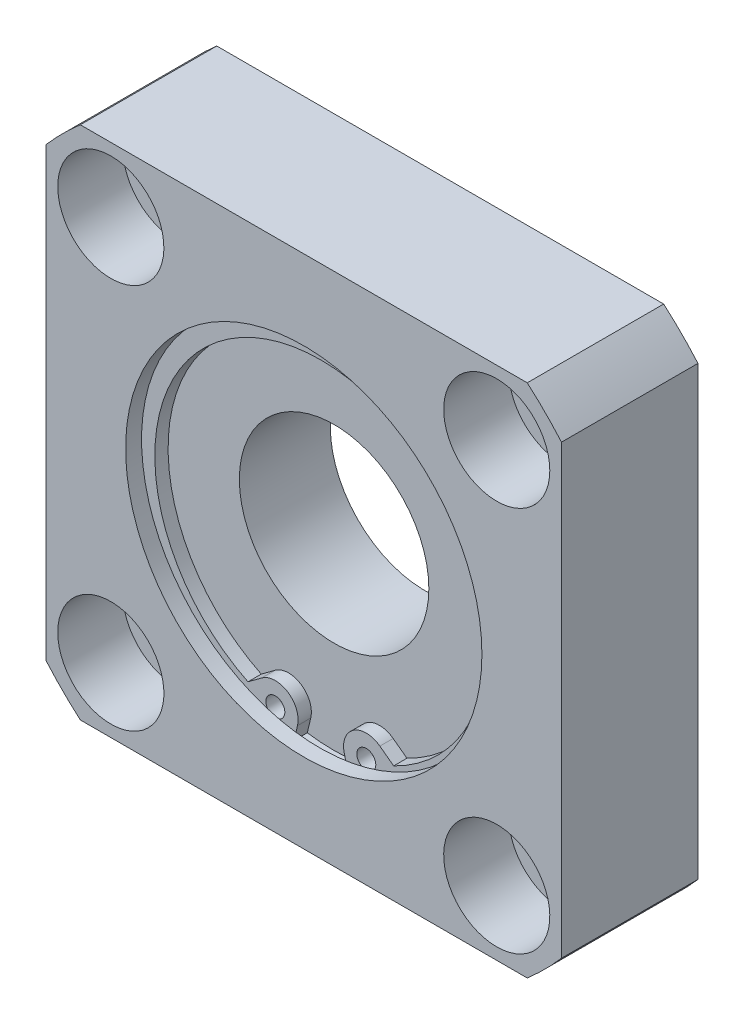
ISO-10303-21;
HEADER;
FILE_DESCRIPTION(('STEP AP214'),'2;1');
FILE_NAME('part.step','',(''),(''),'','','');
FILE_SCHEMA(('AUTOMOTIVE_DESIGN { 1 0 10303 214 1 1 1 1 }'));
ENDSEC;
DATA;
#1=APPLICATION_CONTEXT('core data for automotive mechanical design processes');
#2=APPLICATION_PROTOCOL_DEFINITION('international standard','automotive_design',2000,#1);
#3=PRODUCT_CONTEXT('',#1,'mechanical');
#4=PRODUCT('Part','Part','',(#3));
#5=PRODUCT_RELATED_PRODUCT_CATEGORY('part','',(#4));
#6=PRODUCT_DEFINITION_FORMATION('','',#4);
#7=PRODUCT_DEFINITION_CONTEXT('part definition',#1,'design');
#8=PRODUCT_DEFINITION('design','',#6,#7);
#9=PRODUCT_DEFINITION_SHAPE('','',#8);
#10=(LENGTH_UNIT() NAMED_UNIT(*) SI_UNIT(.MILLI.,.METRE.));
#11=(NAMED_UNIT(*) PLANE_ANGLE_UNIT() SI_UNIT($,.RADIAN.));
#12=(NAMED_UNIT(*) SI_UNIT($,.STERADIAN.) SOLID_ANGLE_UNIT());
#13=UNCERTAINTY_MEASURE_WITH_UNIT(LENGTH_MEASURE(1.E-05),#10,'distance_accuracy_value','');
#14=(GEOMETRIC_REPRESENTATION_CONTEXT(3) GLOBAL_UNCERTAINTY_ASSIGNED_CONTEXT((#13)) GLOBAL_UNIT_ASSIGNED_CONTEXT((#10,
#11,#12)) REPRESENTATION_CONTEXT('',''));
#15=CARTESIAN_POINT('',(0.,0.,0.));
#16=DIRECTION('',(0.,0.,1.));
#17=DIRECTION('',(1.,0.,0.));
#18=AXIS2_PLACEMENT_3D('',#15,#16,#17);
#19=CARTESIAN_POINT('',(25.4558441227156,25.4558441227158,0.));
#20=DIRECTION('',(0.,0.,1.));
#21=DIRECTION('',(1.,0.,0.));
#22=AXIS2_PLACEMENT_3D('',#19,#20,#21);
#23=CYLINDRICAL_SURFACE('',#22,5.);
#24=CARTESIAN_POINT('',(25.4558441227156,25.4558441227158,0.));
#25=DIRECTION('',(0.,0.,1.));
#26=DIRECTION('',(1.,0.,0.));
#27=AXIS2_PLACEMENT_3D('',#24,#25,#26);
#28=CIRCLE('',#27,5.);
#29=CARTESIAN_POINT('',(30.4558441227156,25.4558441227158,0.));
#30=VERTEX_POINT('',#29);
#31=EDGE_CURVE('E268',#30,#30,#28,.T.);
#32=ORIENTED_EDGE('',*,*,#31,.F.);
#33=EDGE_LOOP('',(#32));
#34=FACE_BOUND('',#33,.T.);
#35=CARTESIAN_POINT('',(25.4558441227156,25.4558441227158,9.4));
#36=DIRECTION('',(0.,0.,1.));
#37=DIRECTION('',(1.,0.,0.));
#38=AXIS2_PLACEMENT_3D('',#35,#36,#37);
#39=CIRCLE('',#38,5.);
#40=CARTESIAN_POINT('',(30.4558441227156,25.4558441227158,9.4));
#41=VERTEX_POINT('',#40);
#42=EDGE_CURVE('E267',#41,#41,#39,.F.);
#43=ORIENTED_EDGE('',*,*,#42,.F.);
#44=EDGE_LOOP('',(#43));
#45=FACE_BOUND('',#44,.T.);
#46=ADVANCED_FACE('F14',(#34,#45),#23,.F.);
#47=CARTESIAN_POINT('',(25.4558441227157,-25.4558441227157,0.));
#48=DIRECTION('',(0.,0.,1.));
#49=DIRECTION('',(1.,0.,0.));
#50=AXIS2_PLACEMENT_3D('',#47,#48,#49);
#51=CYLINDRICAL_SURFACE('',#50,5.);
#52=CARTESIAN_POINT('',(25.4558441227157,-25.4558441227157,0.));
#53=DIRECTION('',(0.,0.,1.));
#54=DIRECTION('',(0.,-1.,0.));
#55=AXIS2_PLACEMENT_3D('',#52,#53,#54);
#56=CIRCLE('',#55,5.);
#57=CARTESIAN_POINT('',(25.4558441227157,-30.4558441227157,0.));
#58=VERTEX_POINT('',#57);
#59=EDGE_CURVE('E258',#58,#58,#56,.T.);
#60=ORIENTED_EDGE('',*,*,#59,.F.);
#61=EDGE_LOOP('',(#60));
#62=FACE_BOUND('',#61,.T.);
#63=CARTESIAN_POINT('',(25.4558441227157,-25.4558441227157,9.4));
#64=DIRECTION('',(0.,0.,1.));
#65=DIRECTION('',(1.,0.,0.));
#66=AXIS2_PLACEMENT_3D('',#63,#64,#65);
#67=CIRCLE('',#66,5.);
#68=CARTESIAN_POINT('',(30.4558441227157,-25.4558441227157,9.4));
#69=VERTEX_POINT('',#68);
#70=EDGE_CURVE('E251',#69,#69,#67,.F.);
#71=ORIENTED_EDGE('',*,*,#70,.F.);
#72=EDGE_LOOP('',(#71));
#73=FACE_BOUND('',#72,.T.);
#74=ADVANCED_FACE('F466',(#62,#73),#51,.F.);
#75=CARTESIAN_POINT('',(-25.4558441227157,-25.4558441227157,0.));
#76=DIRECTION('',(0.,0.,1.));
#77=DIRECTION('',(1.,0.,0.));
#78=AXIS2_PLACEMENT_3D('',#75,#76,#77);
#79=CYLINDRICAL_SURFACE('',#78,5.);
#80=CARTESIAN_POINT('',(-25.4558441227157,-25.4558441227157,0.));
#81=DIRECTION('',(0.,0.,1.));
#82=DIRECTION('',(-1.,0.,0.));
#83=AXIS2_PLACEMENT_3D('',#80,#81,#82);
#84=CIRCLE('',#83,5.);
#85=CARTESIAN_POINT('',(-30.4558441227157,-25.4558441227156,0.));
#86=VERTEX_POINT('',#85);
#87=EDGE_CURVE('E255',#86,#86,#84,.T.);
#88=ORIENTED_EDGE('',*,*,#87,.F.);
#89=EDGE_LOOP('',(#88));
#90=FACE_BOUND('',#89,.T.);
#91=CARTESIAN_POINT('',(-25.4558441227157,-25.4558441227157,9.4));
#92=DIRECTION('',(0.,0.,1.));
#93=DIRECTION('',(1.,0.,0.));
#94=AXIS2_PLACEMENT_3D('',#91,#92,#93);
#95=CIRCLE('',#94,5.);
#96=CARTESIAN_POINT('',(-20.4558441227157,-25.4558441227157,9.4));
#97=VERTEX_POINT('',#96);
#98=EDGE_CURVE('E244',#97,#97,#95,.F.);
#99=ORIENTED_EDGE('',*,*,#98,.F.);
#100=EDGE_LOOP('',(#99));
#101=FACE_BOUND('',#100,.T.);
#102=ADVANCED_FACE('F480',(#90,#101),#79,.F.);
#103=CARTESIAN_POINT('',(-25.4558441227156,25.4558441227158,0.));
#104=DIRECTION('',(0.,0.,1.));
#105=DIRECTION('',(1.,0.,0.));
#106=AXIS2_PLACEMENT_3D('',#103,#104,#105);
#107=CYLINDRICAL_SURFACE('',#106,5.);
#108=CARTESIAN_POINT('',(-25.4558441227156,25.4558441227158,0.));
#109=DIRECTION('',(0.,0.,1.));
#110=DIRECTION('',(0.,1.,0.));
#111=AXIS2_PLACEMENT_3D('',#108,#109,#110);
#112=CIRCLE('',#111,5.);
#113=CARTESIAN_POINT('',(-25.4558441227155,30.4558441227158,0.));
#114=VERTEX_POINT('',#113);
#115=EDGE_CURVE('E252',#114,#114,#112,.T.);
#116=ORIENTED_EDGE('',*,*,#115,.F.);
#117=EDGE_LOOP('',(#116));
#118=FACE_BOUND('',#117,.T.);
#119=CARTESIAN_POINT('',(-25.4558441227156,25.4558441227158,9.4));
#120=DIRECTION('',(0.,0.,1.));
#121=DIRECTION('',(1.,0.,0.));
#122=AXIS2_PLACEMENT_3D('',#119,#120,#121);
#123=CIRCLE('',#122,5.);
#124=CARTESIAN_POINT('',(-20.4558441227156,25.4558441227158,9.4));
#125=VERTEX_POINT('',#124);
#126=EDGE_CURVE('E237',#125,#125,#123,.F.);
#127=ORIENTED_EDGE('',*,*,#126,.F.);
#128=EDGE_LOOP('',(#127));
#129=FACE_BOUND('',#128,.T.);
#130=ADVANCED_FACE('F476',(#118,#129),#107,.F.);
#131=CARTESIAN_POINT('',(25.4558441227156,25.4558441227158,9.4));
#132=DIRECTION('',(0.,0.,1.));
#133=DIRECTION('',(1.,0.,0.));
#134=AXIS2_PLACEMENT_3D('',#131,#132,#133);
#135=PLANE('',#134);
#136=CARTESIAN_POINT('',(25.4558441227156,25.4558441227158,9.4));
#137=DIRECTION('',(0.,0.,1.));
#138=DIRECTION('',(1.,0.,0.));
#139=AXIS2_PLACEMENT_3D('',#136,#137,#138);
#140=CIRCLE('',#139,7.);
#141=CARTESIAN_POINT('',(32.4558441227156,25.4558441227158,9.4));
#142=VERTEX_POINT('',#141);
#143=EDGE_CURVE('E264',#142,#142,#140,.T.);
#144=ORIENTED_EDGE('',*,*,#143,.T.);
#145=EDGE_LOOP('',(#144));
#146=FACE_BOUND('',#145,.T.);
#147=ORIENTED_EDGE('',*,*,#42,.T.);
#148=EDGE_LOOP('',(#147));
#149=FACE_BOUND('',#148,.T.);
#150=ADVANCED_FACE('F472',(#146,#149),#135,.T.);
#151=CARTESIAN_POINT('',(25.4558441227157,-25.4558441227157,9.4));
#152=DIRECTION('',(0.,0.,1.));
#153=DIRECTION('',(0.,-1.,0.));
#154=AXIS2_PLACEMENT_3D('',#151,#152,#153);
#155=PLANE('',#154);
#156=CARTESIAN_POINT('',(25.4558441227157,-25.4558441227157,9.4));
#157=DIRECTION('',(0.,0.,1.));
#158=DIRECTION('',(0.,-1.,0.));
#159=AXIS2_PLACEMENT_3D('',#156,#157,#158);
#160=CIRCLE('',#159,7.);
#161=CARTESIAN_POINT('',(25.4558441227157,-32.4558441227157,9.4));
#162=VERTEX_POINT('',#161);
#163=EDGE_CURVE('E248',#162,#162,#160,.T.);
#164=ORIENTED_EDGE('',*,*,#163,.T.);
#165=EDGE_LOOP('',(#164));
#166=FACE_BOUND('',#165,.T.);
#167=ORIENTED_EDGE('',*,*,#70,.T.);
#168=EDGE_LOOP('',(#167));
#169=FACE_BOUND('',#168,.T.);
#170=ADVANCED_FACE('F475',(#166,#169),#155,.T.);
#171=CARTESIAN_POINT('',(-25.4558441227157,-25.4558441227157,9.4));
#172=DIRECTION('',(0.,0.,1.));
#173=DIRECTION('',(-1.,0.,0.));
#174=AXIS2_PLACEMENT_3D('',#171,#172,#173);
#175=PLANE('',#174);
#176=CARTESIAN_POINT('',(-25.4558441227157,-25.4558441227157,9.4));
#177=DIRECTION('',(0.,0.,1.));
#178=DIRECTION('',(-1.,0.,0.));
#179=AXIS2_PLACEMENT_3D('',#176,#177,#178);
#180=CIRCLE('',#179,7.);
#181=CARTESIAN_POINT('',(-32.4558441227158,-25.4558441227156,9.4));
#182=VERTEX_POINT('',#181);
#183=EDGE_CURVE('E241',#182,#182,#180,.T.);
#184=ORIENTED_EDGE('',*,*,#183,.T.);
#185=EDGE_LOOP('',(#184));
#186=FACE_BOUND('',#185,.T.);
#187=ORIENTED_EDGE('',*,*,#98,.T.);
#188=EDGE_LOOP('',(#187));
#189=FACE_BOUND('',#188,.T.);
#190=ADVANCED_FACE('F494',(#186,#189),#175,.T.);
#191=CARTESIAN_POINT('',(-25.4558441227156,25.4558441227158,9.4));
#192=DIRECTION('',(0.,0.,1.));
#193=DIRECTION('',(0.,1.,0.));
#194=AXIS2_PLACEMENT_3D('',#191,#192,#193);
#195=PLANE('',#194);
#196=CARTESIAN_POINT('',(-25.4558441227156,25.4558441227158,9.4));
#197=DIRECTION('',(0.,0.,1.));
#198=DIRECTION('',(0.,1.,0.));
#199=AXIS2_PLACEMENT_3D('',#196,#197,#198);
#200=CIRCLE('',#199,7.);
#201=CARTESIAN_POINT('',(-25.4558441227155,32.4558441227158,9.4));
#202=VERTEX_POINT('',#201);
#203=EDGE_CURVE('E234',#202,#202,#200,.T.);
#204=ORIENTED_EDGE('',*,*,#203,.T.);
#205=EDGE_LOOP('',(#204));
#206=FACE_BOUND('',#205,.T.);
#207=ORIENTED_EDGE('',*,*,#126,.T.);
#208=EDGE_LOOP('',(#207));
#209=FACE_BOUND('',#208,.T.);
#210=ADVANCED_FACE('F457',(#206,#209),#195,.T.);
#211=CARTESIAN_POINT('',(0.,0.,0.));
#212=DIRECTION('',(0.,0.,-1.));
#213=DIRECTION('',(-1.,0.,0.));
#214=AXIS2_PLACEMENT_3D('',#211,#212,#213);
#215=PLANE('',#214);
#216=CARTESIAN_POINT('',(0.,0.,0.));
#217=DIRECTION('',(0.,0.,-1.));
#218=DIRECTION('',(-1.,0.,0.));
#219=AXIS2_PLACEMENT_3D('',#216,#217,#218);
#220=CIRCLE('',#219,20.5);
#221=CARTESIAN_POINT('',(-20.5,0.,0.));
#222=VERTEX_POINT('',#221);
#223=EDGE_CURVE('E220',#222,#222,#220,.T.);
#224=ORIENTED_EDGE('',*,*,#223,.F.);
#225=EDGE_LOOP('',(#224));
#226=FACE_BOUND('',#225,.T.);
#227=ORIENTED_EDGE('',*,*,#115,.T.);
#228=EDGE_LOOP('',(#227));
#229=FACE_BOUND('',#228,.T.);
#230=ORIENTED_EDGE('',*,*,#87,.T.);
#231=EDGE_LOOP('',(#230));
#232=FACE_BOUND('',#231,.T.);
#233=ORIENTED_EDGE('',*,*,#59,.T.);
#234=EDGE_LOOP('',(#233));
#235=FACE_BOUND('',#234,.T.);
#236=ORIENTED_EDGE('',*,*,#31,.T.);
#237=EDGE_LOOP('',(#236));
#238=FACE_BOUND('',#237,.T.);
#239=CARTESIAN_POINT('',(0.,0.,0.));
#240=DIRECTION('',(0.,0.,-1.));
#241=DIRECTION('',(-1.,0.,0.));
#242=AXIS2_PLACEMENT_3D('',#239,#240,#241);
#243=CIRCLE('',#242,45.);
#244=CARTESIAN_POINT('',(34.,-29.4788059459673,0.));
#245=VERTEX_POINT('',#244);
#246=CARTESIAN_POINT('',(29.4788059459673,-34.,0.));
#247=VERTEX_POINT('',#246);
#248=EDGE_CURVE('E271',#245,#247,#243,.T.);
#249=ORIENTED_EDGE('',*,*,#248,.T.);
#250=DIRECTION('',(1.,0.,0.));
#251=VECTOR('',#250,1.);
#252=CARTESIAN_POINT('',(-29.4788059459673,-34.,0.));
#253=LINE('',#252,#251);
#254=CARTESIAN_POINT('',(-29.4788059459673,-34.,0.));
#255=VERTEX_POINT('',#254);
#256=EDGE_CURVE('E273',#255,#247,#253,.T.);
#257=ORIENTED_EDGE('',*,*,#256,.F.);
#258=CARTESIAN_POINT('',(0.,0.,0.));
#259=DIRECTION('',(0.,0.,1.));
#260=DIRECTION('',(1.,0.,0.));
#261=AXIS2_PLACEMENT_3D('',#258,#259,#260);
#262=CIRCLE('',#261,45.);
#263=CARTESIAN_POINT('',(-34.,-29.4788059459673,0.));
#264=VERTEX_POINT('',#263);
#265=EDGE_CURVE('E276',#264,#255,#262,.T.);
#266=ORIENTED_EDGE('',*,*,#265,.F.);
#267=DIRECTION('',(0.,1.,0.));
#268=VECTOR('',#267,1.);
#269=CARTESIAN_POINT('',(-34.,-29.4788059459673,0.));
#270=LINE('',#269,#268);
#271=CARTESIAN_POINT('',(-34.,29.4788059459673,0.));
#272=VERTEX_POINT('',#271);
#273=EDGE_CURVE('E279',#264,#272,#270,.T.);
#274=ORIENTED_EDGE('',*,*,#273,.T.);
#275=CARTESIAN_POINT('',(0.,0.,0.));
#276=DIRECTION('',(0.,0.,-1.));
#277=DIRECTION('',(-1.,0.,0.));
#278=AXIS2_PLACEMENT_3D('',#275,#276,#277);
#279=CIRCLE('',#278,45.);
#280=CARTESIAN_POINT('',(-29.4788059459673,34.,0.));
#281=VERTEX_POINT('',#280);
#282=EDGE_CURVE('E282',#272,#281,#279,.T.);
#283=ORIENTED_EDGE('',*,*,#282,.T.);
#284=DIRECTION('',(1.,0.,0.));
#285=VECTOR('',#284,1.);
#286=CARTESIAN_POINT('',(-29.4788059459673,34.,0.));
#287=LINE('',#286,#285);
#288=CARTESIAN_POINT('',(29.4788059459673,34.,0.));
#289=VERTEX_POINT('',#288);
#290=EDGE_CURVE('E285',#281,#289,#287,.T.);
#291=ORIENTED_EDGE('',*,*,#290,.T.);
#292=CARTESIAN_POINT('',(0.,0.,0.));
#293=DIRECTION('',(0.,0.,1.));
#294=DIRECTION('',(1.,0.,0.));
#295=AXIS2_PLACEMENT_3D('',#292,#293,#294);
#296=CIRCLE('',#295,45.);
#297=CARTESIAN_POINT('',(34.,29.4788059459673,0.));
#298=VERTEX_POINT('',#297);
#299=EDGE_CURVE('E288',#298,#289,#296,.T.);
#300=ORIENTED_EDGE('',*,*,#299,.F.);
#301=DIRECTION('',(0.,1.,0.));
#302=VECTOR('',#301,1.);
#303=CARTESIAN_POINT('',(34.,-29.4788059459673,0.));
#304=LINE('',#303,#302);
#305=EDGE_CURVE('E291',#245,#298,#304,.T.);
#306=ORIENTED_EDGE('',*,*,#305,.F.);
#307=EDGE_LOOP('',(#249,#257,#266,#274,#283,#291,#300,#306));
#308=FACE_BOUND('',#307,.T.);
#309=ADVANCED_FACE('F444',(#226,#229,#232,#235,#238,#308),#215,.T.);
#310=CARTESIAN_POINT('',(-29.4788059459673,-34.,18.));
#311=DIRECTION('',(0.,1.,0.));
#312=DIRECTION('',(0.,0.,1.));
#313=AXIS2_PLACEMENT_3D('',#310,#311,#312);
#314=PLANE('',#313);
#315=DIRECTION('',(1.,0.,0.));
#316=VECTOR('',#315,1.);
#317=CARTESIAN_POINT('',(-29.4788059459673,-34.,18.));
#318=LINE('',#317,#316);
#319=CARTESIAN_POINT('',(-29.4788059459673,-34.,18.));
#320=VERTEX_POINT('',#319);
#321=CARTESIAN_POINT('',(29.4788059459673,-34.,18.));
#322=VERTEX_POINT('',#321);
#323=EDGE_CURVE('E296',#320,#322,#318,.T.);
#324=ORIENTED_EDGE('',*,*,#323,.F.);
#325=DIRECTION('',(0.,0.,-1.));
#326=VECTOR('',#325,1.);
#327=CARTESIAN_POINT('',(-29.4788059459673,-34.,18.));
#328=LINE('',#327,#326);
#329=EDGE_CURVE('E318',#320,#255,#328,.T.);
#330=ORIENTED_EDGE('',*,*,#329,.T.);
#331=ORIENTED_EDGE('',*,*,#256,.T.);
#332=DIRECTION('',(0.,0.,-1.));
#333=VECTOR('',#332,1.);
#334=CARTESIAN_POINT('',(29.4788059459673,-34.,18.));
#335=LINE('',#334,#333);
#336=EDGE_CURVE('E74',#322,#247,#335,.T.);
#337=ORIENTED_EDGE('',*,*,#336,.F.);
#338=EDGE_LOOP('',(#324,#330,#331,#337));
#339=FACE_BOUND('',#338,.T.);
#340=ADVANCED_FACE('F440',(#339),#314,.F.);
#341=CARTESIAN_POINT('',(0.,0.,18.));
#342=DIRECTION('',(0.,0.,-1.));
#343=DIRECTION('',(-1.,0.,0.));
#344=AXIS2_PLACEMENT_3D('',#341,#342,#343);
#345=CYLINDRICAL_SURFACE('',#344,45.);
#346=ORIENTED_EDGE('',*,*,#329,.F.);
#347=CARTESIAN_POINT('',(0.,0.,18.));
#348=DIRECTION('',(0.,0.,1.));
#349=DIRECTION('',(1.,0.,0.));
#350=AXIS2_PLACEMENT_3D('',#347,#348,#349);
#351=CIRCLE('',#350,45.);
#352=CARTESIAN_POINT('',(-34.,-29.4788059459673,18.));
#353=VERTEX_POINT('',#352);
#354=EDGE_CURVE('E299',#353,#320,#351,.T.);
#355=ORIENTED_EDGE('',*,*,#354,.F.);
#356=DIRECTION('',(0.,0.,-1.));
#357=VECTOR('',#356,1.);
#358=CARTESIAN_POINT('',(-34.,-29.4788059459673,18.));
#359=LINE('',#358,#357);
#360=EDGE_CURVE('E320',#353,#264,#359,.T.);
#361=ORIENTED_EDGE('',*,*,#360,.T.);
#362=ORIENTED_EDGE('',*,*,#265,.T.);
#363=EDGE_LOOP('',(#346,#355,#361,#362));
#364=FACE_BOUND('',#363,.T.);
#365=ADVANCED_FACE('F436',(#364),#345,.T.);
#366=CARTESIAN_POINT('',(-34.,-29.4788059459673,18.));
#367=DIRECTION('',(-1.,0.,0.));
#368=DIRECTION('',(0.,0.,1.));
#369=AXIS2_PLACEMENT_3D('',#366,#367,#368);
#370=PLANE('',#369);
#371=ORIENTED_EDGE('',*,*,#360,.F.);
#372=DIRECTION('',(0.,1.,0.));
#373=VECTOR('',#372,1.);
#374=CARTESIAN_POINT('',(-34.,-29.4788059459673,18.));
#375=LINE('',#374,#373);
#376=CARTESIAN_POINT('',(-34.,29.4788059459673,18.));
#377=VERTEX_POINT('',#376);
#378=EDGE_CURVE('E302',#353,#377,#375,.T.);
#379=ORIENTED_EDGE('',*,*,#378,.T.);
#380=DIRECTION('',(0.,0.,-1.));
#381=VECTOR('',#380,1.);
#382=CARTESIAN_POINT('',(-34.,29.4788059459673,18.));
#383=LINE('',#382,#381);
#384=EDGE_CURVE('E322',#377,#272,#383,.T.);
#385=ORIENTED_EDGE('',*,*,#384,.T.);
#386=ORIENTED_EDGE('',*,*,#273,.F.);
#387=EDGE_LOOP('',(#371,#379,#385,#386));
#388=FACE_BOUND('',#387,.T.);
#389=ADVANCED_FACE('F432',(#388),#370,.T.);
#390=CARTESIAN_POINT('',(0.,0.,18.));
#391=DIRECTION('',(0.,0.,-1.));
#392=DIRECTION('',(-1.,0.,0.));
#393=AXIS2_PLACEMENT_3D('',#390,#391,#392);
#394=CYLINDRICAL_SURFACE('',#393,45.);
#395=ORIENTED_EDGE('',*,*,#384,.F.);
#396=CARTESIAN_POINT('',(0.,0.,18.));
#397=DIRECTION('',(0.,0.,-1.));
#398=DIRECTION('',(-1.,0.,0.));
#399=AXIS2_PLACEMENT_3D('',#396,#397,#398);
#400=CIRCLE('',#399,45.);
#401=CARTESIAN_POINT('',(-29.4788059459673,34.,18.));
#402=VERTEX_POINT('',#401);
#403=EDGE_CURVE('E305',#377,#402,#400,.T.);
#404=ORIENTED_EDGE('',*,*,#403,.T.);
#405=DIRECTION('',(0.,0.,-1.));
#406=VECTOR('',#405,1.);
#407=CARTESIAN_POINT('',(-29.4788059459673,34.,18.));
#408=LINE('',#407,#406);
#409=EDGE_CURVE('E324',#402,#281,#408,.T.);
#410=ORIENTED_EDGE('',*,*,#409,.T.);
#411=ORIENTED_EDGE('',*,*,#282,.F.);
#412=EDGE_LOOP('',(#395,#404,#410,#411));
#413=FACE_BOUND('',#412,.T.);
#414=ADVANCED_FACE('F428',(#413),#394,.T.);
#415=CARTESIAN_POINT('',(-29.4788059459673,34.,18.));
#416=DIRECTION('',(0.,1.,0.));
#417=DIRECTION('',(0.,0.,1.));
#418=AXIS2_PLACEMENT_3D('',#415,#416,#417);
#419=PLANE('',#418);
#420=ORIENTED_EDGE('',*,*,#409,.F.);
#421=DIRECTION('',(1.,0.,0.));
#422=VECTOR('',#421,1.);
#423=CARTESIAN_POINT('',(-29.4788059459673,34.,18.));
#424=LINE('',#423,#422);
#425=CARTESIAN_POINT('',(29.4788059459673,34.,18.));
#426=VERTEX_POINT('',#425);
#427=EDGE_CURVE('E308',#402,#426,#424,.T.);
#428=ORIENTED_EDGE('',*,*,#427,.T.);
#429=DIRECTION('',(0.,0.,-1.));
#430=VECTOR('',#429,1.);
#431=CARTESIAN_POINT('',(29.4788059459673,34.,18.));
#432=LINE('',#431,#430);
#433=EDGE_CURVE('E326',#426,#289,#432,.T.);
#434=ORIENTED_EDGE('',*,*,#433,.T.);
#435=ORIENTED_EDGE('',*,*,#290,.F.);
#436=EDGE_LOOP('',(#420,#428,#434,#435));
#437=FACE_BOUND('',#436,.T.);
#438=ADVANCED_FACE('F424',(#437),#419,.T.);
#439=CARTESIAN_POINT('',(0.,0.,18.));
#440=DIRECTION('',(0.,0.,-1.));
#441=DIRECTION('',(-1.,0.,0.));
#442=AXIS2_PLACEMENT_3D('',#439,#440,#441);
#443=CYLINDRICAL_SURFACE('',#442,45.);
#444=ORIENTED_EDGE('',*,*,#433,.F.);
#445=CARTESIAN_POINT('',(0.,0.,18.));
#446=DIRECTION('',(0.,0.,1.));
#447=DIRECTION('',(1.,0.,0.));
#448=AXIS2_PLACEMENT_3D('',#445,#446,#447);
#449=CIRCLE('',#448,45.);
#450=CARTESIAN_POINT('',(34.,29.4788059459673,18.));
#451=VERTEX_POINT('',#450);
#452=EDGE_CURVE('E311',#451,#426,#449,.T.);
#453=ORIENTED_EDGE('',*,*,#452,.F.);
#454=DIRECTION('',(0.,0.,-1.));
#455=VECTOR('',#454,1.);
#456=CARTESIAN_POINT('',(34.,29.4788059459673,18.));
#457=LINE('',#456,#455);
#458=EDGE_CURVE('E328',#451,#298,#457,.T.);
#459=ORIENTED_EDGE('',*,*,#458,.T.);
#460=ORIENTED_EDGE('',*,*,#299,.T.);
#461=EDGE_LOOP('',(#444,#453,#459,#460));
#462=FACE_BOUND('',#461,.T.);
#463=ADVANCED_FACE('F420',(#462),#443,.T.);
#464=CARTESIAN_POINT('',(34.,-29.4788059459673,18.));
#465=DIRECTION('',(-1.,0.,0.));
#466=DIRECTION('',(0.,0.,1.));
#467=AXIS2_PLACEMENT_3D('',#464,#465,#466);
#468=PLANE('',#467);
#469=ORIENTED_EDGE('',*,*,#458,.F.);
#470=DIRECTION('',(0.,1.,0.));
#471=VECTOR('',#470,1.);
#472=CARTESIAN_POINT('',(34.,-29.4788059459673,18.));
#473=LINE('',#472,#471);
#474=CARTESIAN_POINT('',(34.,-29.4788059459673,18.));
#475=VERTEX_POINT('',#474);
#476=EDGE_CURVE('E314',#475,#451,#473,.T.);
#477=ORIENTED_EDGE('',*,*,#476,.F.);
#478=DIRECTION('',(0.,0.,-1.));
#479=VECTOR('',#478,1.);
#480=CARTESIAN_POINT('',(34.,-29.4788059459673,18.));
#481=LINE('',#480,#479);
#482=EDGE_CURVE('E330',#475,#245,#481,.T.);
#483=ORIENTED_EDGE('',*,*,#482,.T.);
#484=ORIENTED_EDGE('',*,*,#305,.T.);
#485=EDGE_LOOP('',(#469,#477,#483,#484));
#486=FACE_BOUND('',#485,.T.);
#487=ADVANCED_FACE('F416',(#486),#468,.F.);
#488=CARTESIAN_POINT('',(0.,0.,18.));
#489=DIRECTION('',(0.,0.,-1.));
#490=DIRECTION('',(-1.,0.,0.));
#491=AXIS2_PLACEMENT_3D('',#488,#489,#490);
#492=CYLINDRICAL_SURFACE('',#491,45.);
#493=ORIENTED_EDGE('',*,*,#482,.F.);
#494=CARTESIAN_POINT('',(0.,0.,18.));
#495=DIRECTION('',(0.,0.,-1.));
#496=DIRECTION('',(-1.,0.,0.));
#497=AXIS2_PLACEMENT_3D('',#494,#495,#496);
#498=CIRCLE('',#497,45.);
#499=EDGE_CURVE('E294',#475,#322,#498,.T.);
#500=ORIENTED_EDGE('',*,*,#499,.T.);
#501=ORIENTED_EDGE('',*,*,#336,.T.);
#502=ORIENTED_EDGE('',*,*,#248,.F.);
#503=EDGE_LOOP('',(#493,#500,#501,#502));
#504=FACE_BOUND('',#503,.T.);
#505=ADVANCED_FACE('F419',(#504),#492,.T.);
#506=CARTESIAN_POINT('',(25.4558441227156,25.4558441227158,9.4));
#507=DIRECTION('',(0.,0.,1.));
#508=DIRECTION('',(1.,0.,0.));
#509=AXIS2_PLACEMENT_3D('',#506,#507,#508);
#510=CYLINDRICAL_SURFACE('',#509,7.);
#511=ORIENTED_EDGE('',*,*,#143,.F.);
#512=EDGE_LOOP('',(#511));
#513=FACE_BOUND('',#512,.T.);
#514=CARTESIAN_POINT('',(25.4558441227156,25.4558441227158,18.));
#515=DIRECTION('',(0.,0.,1.));
#516=DIRECTION('',(1.,0.,0.));
#517=AXIS2_PLACEMENT_3D('',#514,#515,#516);
#518=CIRCLE('',#517,7.);
#519=CARTESIAN_POINT('',(32.4558441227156,25.4558441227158,18.));
#520=VERTEX_POINT('',#519);
#521=EDGE_CURVE('E261',#520,#520,#518,.T.);
#522=ORIENTED_EDGE('',*,*,#521,.T.);
#523=EDGE_LOOP('',(#522));
#524=FACE_BOUND('',#523,.T.);
#525=ADVANCED_FACE('F448',(#513,#524),#510,.F.);
#526=CARTESIAN_POINT('',(25.4558441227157,-25.4558441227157,9.4));
#527=DIRECTION('',(0.,0.,1.));
#528=DIRECTION('',(1.,0.,0.));
#529=AXIS2_PLACEMENT_3D('',#526,#527,#528);
#530=CYLINDRICAL_SURFACE('',#529,7.);
#531=ORIENTED_EDGE('',*,*,#163,.F.);
#532=EDGE_LOOP('',(#531));
#533=FACE_BOUND('',#532,.T.);
#534=CARTESIAN_POINT('',(25.4558441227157,-25.4558441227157,18.));
#535=DIRECTION('',(0.,0.,1.));
#536=DIRECTION('',(0.,-1.,0.));
#537=AXIS2_PLACEMENT_3D('',#534,#535,#536);
#538=CIRCLE('',#537,7.);
#539=CARTESIAN_POINT('',(25.4558441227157,-32.4558441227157,18.));
#540=VERTEX_POINT('',#539);
#541=EDGE_CURVE('E245',#540,#540,#538,.T.);
#542=ORIENTED_EDGE('',*,*,#541,.T.);
#543=EDGE_LOOP('',(#542));
#544=FACE_BOUND('',#543,.T.);
#545=ADVANCED_FACE('F470',(#533,#544),#530,.F.);
#546=CARTESIAN_POINT('',(-25.4558441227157,-25.4558441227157,9.4));
#547=DIRECTION('',(0.,0.,1.));
#548=DIRECTION('',(1.,0.,0.));
#549=AXIS2_PLACEMENT_3D('',#546,#547,#548);
#550=CYLINDRICAL_SURFACE('',#549,7.);
#551=ORIENTED_EDGE('',*,*,#183,.F.);
#552=EDGE_LOOP('',(#551));
#553=FACE_BOUND('',#552,.T.);
#554=CARTESIAN_POINT('',(-25.4558441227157,-25.4558441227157,18.));
#555=DIRECTION('',(0.,0.,1.));
#556=DIRECTION('',(-1.,0.,0.));
#557=AXIS2_PLACEMENT_3D('',#554,#555,#556);
#558=CIRCLE('',#557,7.);
#559=CARTESIAN_POINT('',(-32.4558441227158,-25.4558441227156,18.));
#560=VERTEX_POINT('',#559);
#561=EDGE_CURVE('E238',#560,#560,#558,.T.);
#562=ORIENTED_EDGE('',*,*,#561,.T.);
#563=EDGE_LOOP('',(#562));
#564=FACE_BOUND('',#563,.T.);
#565=ADVANCED_FACE('F490',(#553,#564),#550,.F.);
#566=CARTESIAN_POINT('',(-25.4558441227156,25.4558441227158,9.4));
#567=DIRECTION('',(0.,0.,1.));
#568=DIRECTION('',(1.,0.,0.));
#569=AXIS2_PLACEMENT_3D('',#566,#567,#568);
#570=CYLINDRICAL_SURFACE('',#569,7.);
#571=ORIENTED_EDGE('',*,*,#203,.F.);
#572=EDGE_LOOP('',(#571));
#573=FACE_BOUND('',#572,.T.);
#574=CARTESIAN_POINT('',(-25.4558441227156,25.4558441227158,18.));
#575=DIRECTION('',(0.,0.,1.));
#576=DIRECTION('',(0.,1.,0.));
#577=AXIS2_PLACEMENT_3D('',#574,#575,#576);
#578=CIRCLE('',#577,7.);
#579=CARTESIAN_POINT('',(-25.4558441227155,32.4558441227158,18.));
#580=VERTEX_POINT('',#579);
#581=EDGE_CURVE('E231',#580,#580,#578,.T.);
#582=ORIENTED_EDGE('',*,*,#581,.T.);
#583=EDGE_LOOP('',(#582));
#584=FACE_BOUND('',#583,.T.);
#585=ADVANCED_FACE('F498',(#573,#584),#570,.F.);
#586=CARTESIAN_POINT('',(0.,0.,2.));
#587=DIRECTION('',(0.,0.,-1.));
#588=DIRECTION('',(-1.,0.,0.));
#589=AXIS2_PLACEMENT_3D('',#586,#587,#588);
#590=CYLINDRICAL_SURFACE('',#589,20.5);
#591=CARTESIAN_POINT('',(0.,0.,2.));
#592=DIRECTION('',(0.,0.,-1.));
#593=DIRECTION('',(-1.,0.,0.));
#594=AXIS2_PLACEMENT_3D('',#591,#592,#593);
#595=CIRCLE('',#594,20.5);
#596=CARTESIAN_POINT('',(-20.5,0.,2.));
#597=VERTEX_POINT('',#596);
#598=EDGE_CURVE('E223',#597,#597,#595,.T.);
#599=ORIENTED_EDGE('',*,*,#598,.F.);
#600=EDGE_LOOP('',(#599));
#601=FACE_BOUND('',#600,.T.);
#602=ORIENTED_EDGE('',*,*,#223,.T.);
#603=EDGE_LOOP('',(#602));
#604=FACE_BOUND('',#603,.T.);
#605=ADVANCED_FACE('F453',(#601,#604),#590,.F.);
#606=CARTESIAN_POINT('',(0.,0.,18.));
#607=DIRECTION('',(0.,0.,-1.));
#608=DIRECTION('',(-1.,0.,0.));
#609=AXIS2_PLACEMENT_3D('',#606,#607,#608);
#610=PLANE('',#609);
#611=CARTESIAN_POINT('',(0.,0.,18.));
#612=DIRECTION('',(0.,0.,1.));
#613=DIRECTION('',(1.,0.,0.));
#614=AXIS2_PLACEMENT_3D('',#611,#612,#613);
#615=CIRCLE('',#614,23.5);
#616=CARTESIAN_POINT('',(23.5,0.,18.));
#617=VERTEX_POINT('',#616);
#618=EDGE_CURVE('E227',#617,#617,#615,.T.);
#619=ORIENTED_EDGE('',*,*,#618,.F.);
#620=EDGE_LOOP('',(#619));
#621=FACE_BOUND('',#620,.T.);
#622=ORIENTED_EDGE('',*,*,#581,.F.);
#623=EDGE_LOOP('',(#622));
#624=FACE_BOUND('',#623,.T.);
#625=ORIENTED_EDGE('',*,*,#561,.F.);
#626=EDGE_LOOP('',(#625));
#627=FACE_BOUND('',#626,.T.);
#628=ORIENTED_EDGE('',*,*,#541,.F.);
#629=EDGE_LOOP('',(#628));
#630=FACE_BOUND('',#629,.T.);
#631=ORIENTED_EDGE('',*,*,#521,.F.);
#632=EDGE_LOOP('',(#631));
#633=FACE_BOUND('',#632,.T.);
#634=ORIENTED_EDGE('',*,*,#499,.F.);
#635=ORIENTED_EDGE('',*,*,#476,.T.);
#636=ORIENTED_EDGE('',*,*,#452,.T.);
#637=ORIENTED_EDGE('',*,*,#427,.F.);
#638=ORIENTED_EDGE('',*,*,#403,.F.);
#639=ORIENTED_EDGE('',*,*,#378,.F.);
#640=ORIENTED_EDGE('',*,*,#354,.T.);
#641=ORIENTED_EDGE('',*,*,#323,.T.);
#642=EDGE_LOOP('',(#634,#635,#636,#637,#638,#639,#640,#641));
#643=FACE_BOUND('',#642,.T.);
#644=ADVANCED_FACE('F449',(#621,#624,#627,#630,#633,#643),#610,.F.);
#645=CARTESIAN_POINT('',(0.,0.,2.));
#646=DIRECTION('',(0.,0.,-1.));
#647=DIRECTION('',(-1.,0.,0.));
#648=AXIS2_PLACEMENT_3D('',#645,#646,#647);
#649=PLANE('',#648);
#650=CARTESIAN_POINT('',(0.,0.,2.));
#651=DIRECTION('',(0.,0.,-1.));
#652=DIRECTION('',(-1.,0.,0.));
#653=AXIS2_PLACEMENT_3D('',#650,#651,#652);
#654=CIRCLE('',#653,12.5);
#655=CARTESIAN_POINT('',(-12.5,0.,2.));
#656=VERTEX_POINT('',#655);
#657=EDGE_CURVE('E226',#656,#656,#654,.T.);
#658=ORIENTED_EDGE('',*,*,#657,.F.);
#659=EDGE_LOOP('',(#658));
#660=FACE_BOUND('',#659,.T.);
#661=ORIENTED_EDGE('',*,*,#598,.T.);
#662=EDGE_LOOP('',(#661));
#663=FACE_BOUND('',#662,.T.);
#664=ADVANCED_FACE('F452',(#660,#663),#649,.T.);
#665=CARTESIAN_POINT('',(0.,0.,14.));
#666=DIRECTION('',(0.,0.,1.));
#667=DIRECTION('',(1.,0.,0.));
#668=AXIS2_PLACEMENT_3D('',#665,#666,#667);
#669=CYLINDRICAL_SURFACE('',#668,23.5);
#670=CARTESIAN_POINT('',(0.,0.,15.9));
#671=DIRECTION('',(0.,0.,1.));
#672=DIRECTION('',(1.,0.,0.));
#673=AXIS2_PLACEMENT_3D('',#670,#671,#672);
#674=CIRCLE('',#673,23.5);
#675=CARTESIAN_POINT('',(23.5,0.,15.9));
#676=VERTEX_POINT('',#675);
#677=EDGE_CURVE('E217',#676,#676,#674,.F.);
#678=ORIENTED_EDGE('',*,*,#677,.T.);
#679=EDGE_LOOP('',(#678));
#680=FACE_BOUND('',#679,.T.);
#681=ORIENTED_EDGE('',*,*,#618,.T.);
#682=EDGE_LOOP('',(#681));
#683=FACE_BOUND('',#682,.T.);
#684=ADVANCED_FACE('F462',(#680,#683),#669,.F.);
#685=CARTESIAN_POINT('',(0.,0.,18.));
#686=DIRECTION('',(0.,0.,-1.));
#687=DIRECTION('',(-1.,0.,0.));
#688=AXIS2_PLACEMENT_3D('',#685,#686,#687);
#689=CYLINDRICAL_SURFACE('',#688,12.5);
#690=CARTESIAN_POINT('',(0.,0.,14.));
#691=DIRECTION('',(0.,0.,1.));
#692=DIRECTION('',(1.,0.,0.));
#693=AXIS2_PLACEMENT_3D('',#690,#691,#692);
#694=CIRCLE('',#693,12.5);
#695=CARTESIAN_POINT('',(12.5,0.,14.));
#696=VERTEX_POINT('',#695);
#697=EDGE_CURVE('E230',#696,#696,#694,.T.);
#698=ORIENTED_EDGE('',*,*,#697,.T.);
#699=EDGE_LOOP('',(#698));
#700=FACE_BOUND('',#699,.T.);
#701=ORIENTED_EDGE('',*,*,#657,.T.);
#702=EDGE_LOOP('',(#701));
#703=FACE_BOUND('',#702,.T.);
#704=ADVANCED_FACE('F459',(#700,#703),#689,.F.);
#705=CARTESIAN_POINT('',(0.,0.,14.));
#706=DIRECTION('',(0.,0.,1.));
#707=DIRECTION('',(1.,0.,0.));
#708=AXIS2_PLACEMENT_3D('',#705,#706,#707);
#709=PLANE('',#708);
#710=ORIENTED_EDGE('',*,*,#697,.F.);
#711=EDGE_LOOP('',(#710));
#712=FACE_BOUND('',#711,.T.);
#713=CARTESIAN_POINT('',(0.,0.,14.));
#714=DIRECTION('',(0.,0.,1.));
#715=DIRECTION('',(1.,0.,0.));
#716=AXIS2_PLACEMENT_3D('',#713,#714,#715);
#717=CIRCLE('',#716,24.75);
#718=CARTESIAN_POINT('',(-3.53738888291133,-24.4959053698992,14.));
#719=VERTEX_POINT('',#718);
#720=CARTESIAN_POINT('',(3.53738888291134,-24.4959053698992,14.));
#721=VERTEX_POINT('',#720);
#722=EDGE_CURVE('E207',#719,#721,#717,.T.);
#723=ORIENTED_EDGE('',*,*,#722,.T.);
#724=DIRECTION('',(-0.231349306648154,0.972870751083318,0.));
#725=VECTOR('',#724,1.);
#726=CARTESIAN_POINT('',(-2.16530728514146,-0.514911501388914,14.));
#727=LINE('',#726,#725);
#728=CARTESIAN_POINT('',(3.08138774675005,-22.5783281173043,14.));
#729=VERTEX_POINT('',#728);
#730=EDGE_CURVE('E9',#721,#729,#727,.T.);
#731=ORIENTED_EDGE('',*,*,#730,.T.);
#732=CARTESIAN_POINT('',(6.,-21.8842801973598,14.));
#733=DIRECTION('',(0.,0.,1.));
#734=DIRECTION('',(1.,0.,0.));
#735=AXIS2_PLACEMENT_3D('',#732,#733,#734);
#736=CIRCLE('',#735,3.);
#737=CARTESIAN_POINT('',(7.7896612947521,-19.4765608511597,14.));
#738=VERTEX_POINT('',#737);
#739=EDGE_CURVE('E25',#738,#729,#736,.T.);
#740=ORIENTED_EDGE('',*,*,#739,.F.);
#741=DIRECTION('',(0.802573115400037,-0.596553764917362,0.));
#742=VECTOR('',#741,1.);
#743=CARTESIAN_POINT('',(-6.55279254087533,-8.81579403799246,14.));
#744=LINE('',#743,#742);
#745=CARTESIAN_POINT('',(9.60938951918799,-20.8291674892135,14.));
#746=VERTEX_POINT('',#745);
#747=EDGE_CURVE('E150',#738,#746,#744,.T.);
#748=ORIENTED_EDGE('',*,*,#747,.T.);
#749=CARTESIAN_POINT('',(0.,-1.15,14.));
#750=DIRECTION('',(0.,0.,1.));
#751=DIRECTION('',(1.,0.,0.));
#752=AXIS2_PLACEMENT_3D('',#749,#750,#751);
#753=CIRCLE('',#752,21.9);
#754=CARTESIAN_POINT('',(-9.60938951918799,-20.8291674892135,14.));
#755=VERTEX_POINT('',#754);
#756=EDGE_CURVE('E154',#746,#755,#753,.T.);
#757=ORIENTED_EDGE('',*,*,#756,.T.);
#758=DIRECTION('',(0.802573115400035,0.596553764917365,0.));
#759=VECTOR('',#758,1.);
#760=CARTESIAN_POINT('',(6.55279254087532,-8.81579403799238,14.));
#761=LINE('',#760,#759);
#762=CARTESIAN_POINT('',(-7.7896612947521,-19.4765608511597,14.));
#763=VERTEX_POINT('',#762);
#764=EDGE_CURVE('E169',#755,#763,#761,.T.);
#765=ORIENTED_EDGE('',*,*,#764,.T.);
#766=CARTESIAN_POINT('',(-6.,-21.8842801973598,14.));
#767=DIRECTION('',(0.,0.,1.));
#768=DIRECTION('',(1.,0.,0.));
#769=AXIS2_PLACEMENT_3D('',#766,#767,#768);
#770=CIRCLE('',#769,3.);
#771=CARTESIAN_POINT('',(-3.08138774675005,-22.5783281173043,14.));
#772=VERTEX_POINT('',#771);
#773=EDGE_CURVE('E360',#772,#763,#770,.T.);
#774=ORIENTED_EDGE('',*,*,#773,.F.);
#775=DIRECTION('',(-0.231349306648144,-0.97287075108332,0.));
#776=VECTOR('',#775,1.);
#777=CARTESIAN_POINT('',(2.16530728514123,-0.514911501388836,14.));
#778=LINE('',#777,#776);
#779=EDGE_CURVE('E363',#772,#719,#778,.T.);
#780=ORIENTED_EDGE('',*,*,#779,.T.);
#781=EDGE_LOOP('',(#723,#731,#740,#748,#757,#765,#774,#780));
#782=FACE_BOUND('',#781,.T.);
#783=ADVANCED_FACE('F153',(#712,#782),#709,.T.);
#784=CARTESIAN_POINT('',(0.,0.,15.9));
#785=DIRECTION('',(0.,0.,1.));
#786=DIRECTION('',(1.,0.,0.));
#787=AXIS2_PLACEMENT_3D('',#784,#785,#786);
#788=PLANE('',#787);
#789=CARTESIAN_POINT('',(0.,0.,15.9));
#790=DIRECTION('',(0.,0.,1.));
#791=DIRECTION('',(1.,0.,0.));
#792=AXIS2_PLACEMENT_3D('',#789,#790,#791);
#793=CIRCLE('',#792,24.75);
#794=CARTESIAN_POINT('',(24.75,0.,15.9));
#795=VERTEX_POINT('',#794);
#796=EDGE_CURVE('E213',#795,#795,#793,.T.);
#797=ORIENTED_EDGE('',*,*,#796,.F.);
#798=EDGE_LOOP('',(#797));
#799=FACE_BOUND('',#798,.T.);
#800=ORIENTED_EDGE('',*,*,#677,.F.);
#801=EDGE_LOOP('',(#800));
#802=FACE_BOUND('',#801,.T.);
#803=ADVANCED_FACE('F513',(#799,#802),#788,.F.);
#804=CARTESIAN_POINT('',(0.,0.,15.9));
#805=DIRECTION('',(0.,0.,-1.));
#806=DIRECTION('',(-1.,0.,0.));
#807=AXIS2_PLACEMENT_3D('',#804,#805,#806);
#808=CYLINDRICAL_SURFACE('',#807,24.75);
#809=ORIENTED_EDGE('',*,*,#796,.T.);
#810=EDGE_LOOP('',(#809));
#811=FACE_BOUND('',#810,.T.);
#812=CARTESIAN_POINT('',(0.,0.,15.75));
#813=DIRECTION('',(0.,0.,1.));
#814=DIRECTION('',(1.,0.,0.));
#815=AXIS2_PLACEMENT_3D('',#812,#813,#814);
#816=CIRCLE('',#815,24.75);
#817=CARTESIAN_POINT('',(3.53738888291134,-24.4959053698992,15.75));
#818=VERTEX_POINT('',#817);
#819=CARTESIAN_POINT('',(-3.53738888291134,-24.4959053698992,15.75));
#820=VERTEX_POINT('',#819);
#821=EDGE_CURVE('E332',#818,#820,#816,.T.);
#822=ORIENTED_EDGE('',*,*,#821,.F.);
#823=DIRECTION('',(0.,0.,-1.));
#824=VECTOR('',#823,1.);
#825=CARTESIAN_POINT('',(3.53738888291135,-24.4959053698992,15.9));
#826=LINE('',#825,#824);
#827=EDGE_CURVE('E350',#818,#721,#826,.T.);
#828=ORIENTED_EDGE('',*,*,#827,.T.);
#829=ORIENTED_EDGE('',*,*,#722,.F.);
#830=DIRECTION('',(0.,0.,-1.));
#831=VECTOR('',#830,1.);
#832=CARTESIAN_POINT('',(-3.53738888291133,-24.4959053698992,15.9));
#833=LINE('',#832,#831);
#834=EDGE_CURVE('E348',#719,#820,#833,.F.);
#835=ORIENTED_EDGE('',*,*,#834,.T.);
#836=EDGE_LOOP('',(#822,#828,#829,#835));
#837=FACE_BOUND('',#836,.T.);
#838=ADVANCED_FACE('F521',(#811,#837),#808,.F.);
#839=CARTESIAN_POINT('',(6.,-21.8842801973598,14.));
#840=DIRECTION('',(0.,0.,1.));
#841=DIRECTION('',(1.,0.,0.));
#842=AXIS2_PLACEMENT_3D('',#839,#840,#841);
#843=CIRCLE('',#842,1.25);
#844=CARTESIAN_POINT('',(7.25,-21.8842801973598,14.));
#845=VERTEX_POINT('',#844);
#846=EDGE_CURVE('E353',#845,#845,#843,.T.);
#847=ORIENTED_EDGE('',*,*,#846,.T.);
#848=EDGE_LOOP('',(#847));
#849=FACE_BOUND('',#848,.T.);
#850=ADVANCED_FACE('F387',(#849),#709,.T.);
#851=CARTESIAN_POINT('',(-6.,-21.8842801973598,14.));
#852=DIRECTION('',(0.,0.,1.));
#853=DIRECTION('',(1.,0.,0.));
#854=AXIS2_PLACEMENT_3D('',#851,#852,#853);
#855=CIRCLE('',#854,1.25);
#856=CARTESIAN_POINT('',(-4.75,-21.8842801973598,14.));
#857=VERTEX_POINT('',#856);
#858=EDGE_CURVE('E356',#857,#857,#855,.T.);
#859=ORIENTED_EDGE('',*,*,#858,.T.);
#860=EDGE_LOOP('',(#859));
#861=FACE_BOUND('',#860,.T.);
#862=ADVANCED_FACE('F381',(#861),#709,.T.);
#863=CARTESIAN_POINT('',(6.,-21.8842801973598,15.8));
#864=DIRECTION('',(0.,0.,1.));
#865=DIRECTION('',(-1.,0.,0.));
#866=AXIS2_PLACEMENT_3D('',#863,#864,#865);
#867=CYLINDRICAL_SURFACE('',#866,3.);
#868=DIRECTION('',(0.,0.,-1.));
#869=VECTOR('',#868,1.);
#870=CARTESIAN_POINT('',(3.08138774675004,-22.5783281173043,15.8));
#871=LINE('',#870,#869);
#872=CARTESIAN_POINT('',(3.08138774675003,-22.5783281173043,15.75));
#873=VERTEX_POINT('',#872);
#874=EDGE_CURVE('E181',#873,#729,#871,.T.);
#875=ORIENTED_EDGE('',*,*,#874,.F.);
#876=CARTESIAN_POINT('',(6.,-21.8842801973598,15.75));
#877=DIRECTION('',(0.,0.,1.));
#878=DIRECTION('',(1.,0.,0.));
#879=AXIS2_PLACEMENT_3D('',#876,#877,#878);
#880=CIRCLE('',#879,3.);
#881=CARTESIAN_POINT('',(7.7896612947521,-19.4765608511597,15.75));
#882=VERTEX_POINT('',#881);
#883=EDGE_CURVE('E59',#882,#873,#880,.T.);
#884=ORIENTED_EDGE('',*,*,#883,.F.);
#885=DIRECTION('',(0.,0.,-1.));
#886=VECTOR('',#885,1.);
#887=CARTESIAN_POINT('',(7.7896612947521,-19.4765608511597,15.8));
#888=LINE('',#887,#886);
#889=EDGE_CURVE('E174',#882,#738,#888,.T.);
#890=ORIENTED_EDGE('',*,*,#889,.T.);
#891=ORIENTED_EDGE('',*,*,#739,.T.);
#892=EDGE_LOOP('',(#875,#884,#890,#891));
#893=FACE_BOUND('',#892,.T.);
#894=ADVANCED_FACE('F379',(#893),#867,.T.);
#895=CARTESIAN_POINT('',(7.7896612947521,-19.4765608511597,15.8));
#896=DIRECTION('',(-0.596553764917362,-0.802573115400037,0.));
#897=DIRECTION('',(-0.802573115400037,0.596553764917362,0.));
#898=AXIS2_PLACEMENT_3D('',#895,#896,#897);
#899=PLANE('',#898);
#900=DIRECTION('',(-0.802573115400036,0.596553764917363,0.));
#901=VECTOR('',#900,1.);
#902=CARTESIAN_POINT('',(9.60938951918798,-20.8291674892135,15.75));
#903=LINE('',#902,#901);
#904=CARTESIAN_POINT('',(9.60938951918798,-20.8291674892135,15.75));
#905=VERTEX_POINT('',#904);
#906=EDGE_CURVE('E172',#905,#882,#903,.T.);
#907=ORIENTED_EDGE('',*,*,#906,.F.);
#908=DIRECTION('',(0.,0.,-1.));
#909=VECTOR('',#908,1.);
#910=CARTESIAN_POINT('',(9.60938951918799,-20.8291674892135,15.8));
#911=LINE('',#910,#909);
#912=EDGE_CURVE('E165',#905,#746,#911,.T.);
#913=ORIENTED_EDGE('',*,*,#912,.T.);
#914=ORIENTED_EDGE('',*,*,#747,.F.);
#915=ORIENTED_EDGE('',*,*,#889,.F.);
#916=EDGE_LOOP('',(#907,#913,#914,#915));
#917=FACE_BOUND('',#916,.T.);
#918=ADVANCED_FACE('F16',(#917),#899,.F.);
#919=CARTESIAN_POINT('',(0.,-1.15,15.8));
#920=DIRECTION('',(0.,0.,1.));
#921=DIRECTION('',(-1.,0.,0.));
#922=AXIS2_PLACEMENT_3D('',#919,#920,#921);
#923=CYLINDRICAL_SURFACE('',#922,21.9);
#924=CARTESIAN_POINT('',(0.,-1.15,15.75));
#925=DIRECTION('',(0.,0.,-1.));
#926=DIRECTION('',(1.,0.,0.));
#927=AXIS2_PLACEMENT_3D('',#924,#925,#926);
#928=CIRCLE('',#927,21.9);
#929=CARTESIAN_POINT('',(-9.60938951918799,-20.8291674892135,15.75));
#930=VERTEX_POINT('',#929);
#931=EDGE_CURVE('E372',#930,#905,#928,.T.);
#932=ORIENTED_EDGE('',*,*,#931,.F.);
#933=DIRECTION('',(0.,0.,-1.));
#934=VECTOR('',#933,1.);
#935=CARTESIAN_POINT('',(-9.60938951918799,-20.8291674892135,15.8));
#936=LINE('',#935,#934);
#937=EDGE_CURVE('E167',#930,#755,#936,.T.);
#938=ORIENTED_EDGE('',*,*,#937,.T.);
#939=ORIENTED_EDGE('',*,*,#756,.F.);
#940=ORIENTED_EDGE('',*,*,#912,.F.);
#941=EDGE_LOOP('',(#932,#938,#939,#940));
#942=FACE_BOUND('',#941,.T.);
#943=ADVANCED_FACE('F164',(#942),#923,.F.);
#944=CARTESIAN_POINT('',(-7.7896612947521,-19.4765608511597,15.8));
#945=DIRECTION('',(0.596553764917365,-0.802573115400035,0.));
#946=DIRECTION('',(0.,0.,-1.));
#947=AXIS2_PLACEMENT_3D('',#944,#945,#946);
#948=PLANE('',#947);
#949=DIRECTION('',(-0.802573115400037,-0.596553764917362,0.));
#950=VECTOR('',#949,1.);
#951=CARTESIAN_POINT('',(-7.7896612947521,-19.4765608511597,15.75));
#952=LINE('',#951,#950);
#953=CARTESIAN_POINT('',(-7.7896612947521,-19.4765608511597,15.75));
#954=VERTEX_POINT('',#953);
#955=EDGE_CURVE('E370',#954,#930,#952,.T.);
#956=ORIENTED_EDGE('',*,*,#955,.F.);
#957=DIRECTION('',(0.,0.,-1.));
#958=VECTOR('',#957,1.);
#959=CARTESIAN_POINT('',(-7.7896612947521,-19.4765608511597,15.8));
#960=LINE('',#959,#958);
#961=EDGE_CURVE('E179',#954,#763,#960,.T.);
#962=ORIENTED_EDGE('',*,*,#961,.T.);
#963=ORIENTED_EDGE('',*,*,#764,.F.);
#964=ORIENTED_EDGE('',*,*,#937,.F.);
#965=EDGE_LOOP('',(#956,#962,#963,#964));
#966=FACE_BOUND('',#965,.T.);
#967=ADVANCED_FACE('F391',(#966),#948,.F.);
#968=CARTESIAN_POINT('',(-6.,-21.8842801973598,15.8));
#969=DIRECTION('',(0.,0.,1.));
#970=DIRECTION('',(-1.,0.,0.));
#971=AXIS2_PLACEMENT_3D('',#968,#969,#970);
#972=CYLINDRICAL_SURFACE('',#971,3.);
#973=ORIENTED_EDGE('',*,*,#961,.F.);
#974=CARTESIAN_POINT('',(-6.,-21.8842801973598,15.75));
#975=DIRECTION('',(0.,0.,1.));
#976=DIRECTION('',(1.,0.,0.));
#977=AXIS2_PLACEMENT_3D('',#974,#975,#976);
#978=CIRCLE('',#977,3.);
#979=CARTESIAN_POINT('',(-3.08138774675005,-22.5783281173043,15.75));
#980=VERTEX_POINT('',#979);
#981=EDGE_CURVE('E368',#980,#954,#978,.T.);
#982=ORIENTED_EDGE('',*,*,#981,.F.);
#983=DIRECTION('',(0.,0.,-1.));
#984=VECTOR('',#983,1.);
#985=CARTESIAN_POINT('',(-3.08138774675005,-22.5783281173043,15.8));
#986=LINE('',#985,#984);
#987=EDGE_CURVE('E184',#980,#772,#986,.T.);
#988=ORIENTED_EDGE('',*,*,#987,.T.);
#989=ORIENTED_EDGE('',*,*,#773,.T.);
#990=EDGE_LOOP('',(#973,#982,#988,#989));
#991=FACE_BOUND('',#990,.T.);
#992=ADVANCED_FACE('F394',(#991),#972,.T.);
#993=CARTESIAN_POINT('',(-3.08138774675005,-22.5783281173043,15.8));
#994=DIRECTION('',(-0.97287075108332,0.231349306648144,0.));
#995=DIRECTION('',(0.,0.,1.));
#996=AXIS2_PLACEMENT_3D('',#993,#994,#995);
#997=PLANE('',#996);
#998=ORIENTED_EDGE('',*,*,#834,.F.);
#999=ORIENTED_EDGE('',*,*,#779,.F.);
#1000=ORIENTED_EDGE('',*,*,#987,.F.);
#1001=DIRECTION('',(0.231349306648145,0.97287075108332,0.));
#1002=VECTOR('',#1001,1.);
#1003=CARTESIAN_POINT('',(-3.65352473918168,-24.9842801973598,15.75));
#1004=LINE('',#1003,#1002);
#1005=EDGE_CURVE('E65',#820,#980,#1004,.T.);
#1006=ORIENTED_EDGE('',*,*,#1005,.F.);
#1007=EDGE_LOOP('',(#998,#999,#1000,#1006));
#1008=FACE_BOUND('',#1007,.T.);
#1009=ADVANCED_FACE('F400',(#1008),#997,.F.);
#1010=CARTESIAN_POINT('',(3.08138774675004,-22.5783281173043,15.8));
#1011=DIRECTION('',(0.972870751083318,0.231349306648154,0.));
#1012=DIRECTION('',(0.,0.,-1.));
#1013=AXIS2_PLACEMENT_3D('',#1010,#1011,#1012);
#1014=PLANE('',#1013);
#1015=ORIENTED_EDGE('',*,*,#827,.F.);
#1016=DIRECTION('',(0.231349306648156,-0.972870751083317,0.));
#1017=VECTOR('',#1016,1.);
#1018=CARTESIAN_POINT('',(3.08138774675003,-22.5783281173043,15.75));
#1019=LINE('',#1018,#1017);
#1020=EDGE_CURVE('E375',#873,#818,#1019,.T.);
#1021=ORIENTED_EDGE('',*,*,#1020,.F.);
#1022=ORIENTED_EDGE('',*,*,#874,.T.);
#1023=ORIENTED_EDGE('',*,*,#730,.F.);
#1024=EDGE_LOOP('',(#1015,#1021,#1022,#1023));
#1025=FACE_BOUND('',#1024,.T.);
#1026=ADVANCED_FACE('F378',(#1025),#1014,.F.);
#1027=CARTESIAN_POINT('',(-6.,-21.8842801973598,15.8));
#1028=DIRECTION('',(0.,0.,1.));
#1029=DIRECTION('',(-1.,0.,0.));
#1030=AXIS2_PLACEMENT_3D('',#1027,#1028,#1029);
#1031=CYLINDRICAL_SURFACE('',#1030,1.25);
#1032=ORIENTED_EDGE('',*,*,#858,.F.);
#1033=EDGE_LOOP('',(#1032));
#1034=FACE_BOUND('',#1033,.T.);
#1035=CARTESIAN_POINT('',(-6.,-21.8842801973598,15.75));
#1036=DIRECTION('',(0.,0.,1.));
#1037=DIRECTION('',(1.,0.,0.));
#1038=AXIS2_PLACEMENT_3D('',#1035,#1036,#1037);
#1039=CIRCLE('',#1038,1.25);
#1040=CARTESIAN_POINT('',(-4.75,-21.8842801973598,15.75));
#1041=VERTEX_POINT('',#1040);
#1042=EDGE_CURVE('E192',#1041,#1041,#1039,.F.);
#1043=ORIENTED_EDGE('',*,*,#1042,.F.);
#1044=EDGE_LOOP('',(#1043));
#1045=FACE_BOUND('',#1044,.T.);
#1046=ADVANCED_FACE('F398',(#1034,#1045),#1031,.F.);
#1047=CARTESIAN_POINT('',(6.,-21.8842801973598,15.8));
#1048=DIRECTION('',(0.,0.,1.));
#1049=DIRECTION('',(-1.,0.,0.));
#1050=AXIS2_PLACEMENT_3D('',#1047,#1048,#1049);
#1051=CYLINDRICAL_SURFACE('',#1050,1.25);
#1052=ORIENTED_EDGE('',*,*,#846,.F.);
#1053=EDGE_LOOP('',(#1052));
#1054=FACE_BOUND('',#1053,.T.);
#1055=CARTESIAN_POINT('',(6.,-21.8842801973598,15.75));
#1056=DIRECTION('',(0.,0.,1.));
#1057=DIRECTION('',(1.,0.,0.));
#1058=AXIS2_PLACEMENT_3D('',#1055,#1056,#1057);
#1059=CIRCLE('',#1058,1.25);
#1060=CARTESIAN_POINT('',(7.25,-21.8842801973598,15.75));
#1061=VERTEX_POINT('',#1060);
#1062=EDGE_CURVE('E18',#1061,#1061,#1059,.F.);
#1063=ORIENTED_EDGE('',*,*,#1062,.F.);
#1064=EDGE_LOOP('',(#1063));
#1065=FACE_BOUND('',#1064,.T.);
#1066=ADVANCED_FACE('F395',(#1054,#1065),#1051,.F.);
#1067=CARTESIAN_POINT('',(-6.,-21.8842801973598,15.75));
#1068=DIRECTION('',(0.,0.,1.));
#1069=DIRECTION('',(1.,0.,0.));
#1070=AXIS2_PLACEMENT_3D('',#1067,#1068,#1069);
#1071=PLANE('',#1070);
#1072=ORIENTED_EDGE('',*,*,#1062,.T.);
#1073=EDGE_LOOP('',(#1072));
#1074=FACE_BOUND('',#1073,.T.);
#1075=ORIENTED_EDGE('',*,*,#1042,.T.);
#1076=EDGE_LOOP('',(#1075));
#1077=FACE_BOUND('',#1076,.T.);
#1078=ORIENTED_EDGE('',*,*,#1020,.T.);
#1079=ORIENTED_EDGE('',*,*,#821,.T.);
#1080=ORIENTED_EDGE('',*,*,#1005,.T.);
#1081=ORIENTED_EDGE('',*,*,#981,.T.);
#1082=ORIENTED_EDGE('',*,*,#955,.T.);
#1083=ORIENTED_EDGE('',*,*,#931,.T.);
#1084=ORIENTED_EDGE('',*,*,#906,.T.);
#1085=ORIENTED_EDGE('',*,*,#883,.T.);
#1086=EDGE_LOOP('',(#1078,#1079,#1080,#1081,#1082,#1083,#1084,#1085));
#1087=FACE_BOUND('',#1086,.T.);
#1088=ADVANCED_FACE('F376',(#1074,#1077,#1087),#1071,.T.);
#1089=CLOSED_SHELL('',(#46,#74,#102,#130,#150,#170,#190,#210,#309,#340,#365,#389,#414,#438,#463,
#487,#505,#525,#545,#565,#585,#605,#644,#664,#684,#704,#783,#803,#838,#850,#862,#894,#918,#943,
#967,#992,#1009,#1026,#1046,#1066,#1088));
#1090=MANIFOLD_SOLID_BREP('B1',#1089);
#1091=ADVANCED_BREP_SHAPE_REPRESENTATION('',(#18,#1090),#14);
#1092=SHAPE_DEFINITION_REPRESENTATION(#9,#1091);
ENDSEC;
END-ISO-10303-21;
